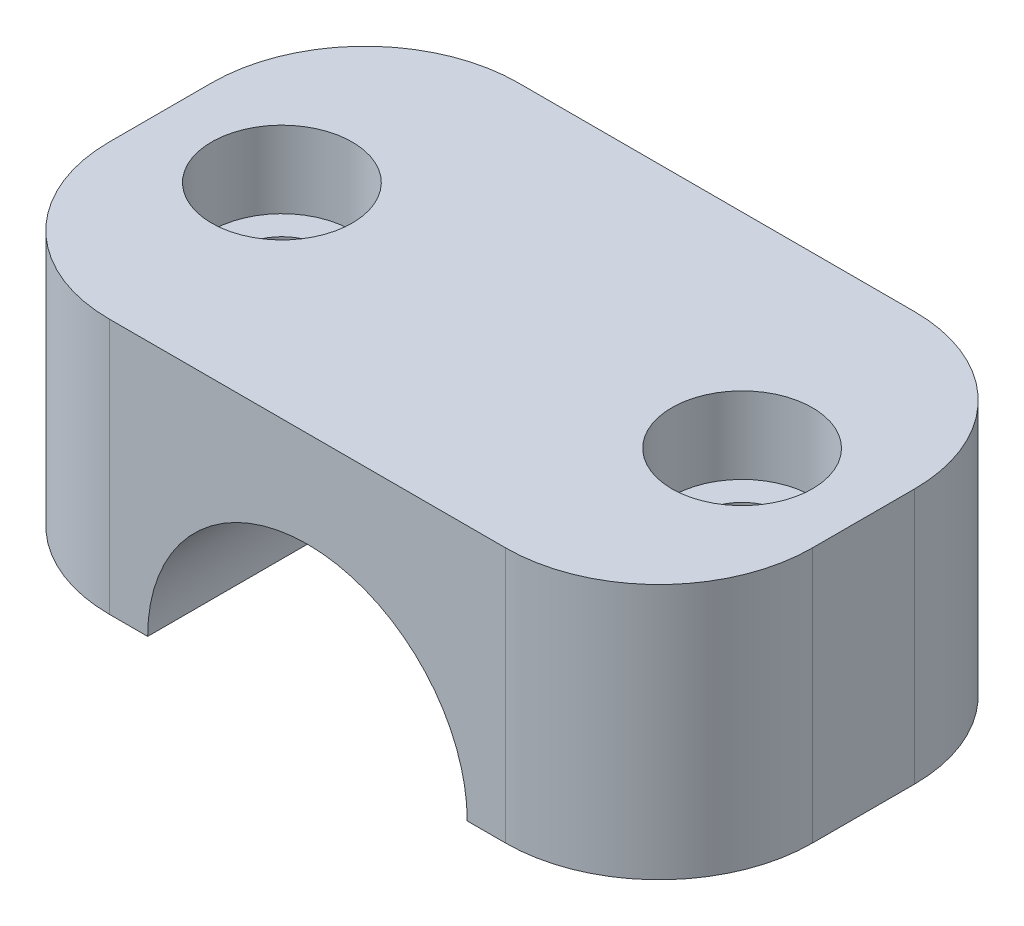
from build123d import *

# Parameters (mm, degrees)
SKETCH1_W                      = 55
SKETCH1_H                      = 20
BOSS_EXTRUDE1_DEPTH            = 16
SKETCH2_R                      = 12.5
CUT_EXTRUDE1_DEPTH             = 47.693147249
FILLET1_R                      = 12
CBORE_FOR_M6_SHCS2_D           = 6.6
CBORE_FOR_M6_SHCS2_CBORE_D     = 11
CBORE_FOR_M6_SHCS2_CBORE_DEPTH = 6


with BuildPart() as part:
    # Sketch1 → Boss-Extrude1 (new, symmetric)
    with BuildSketch(Plane.XY):
        with Locations((0, 10)):
            Rectangle(SKETCH1_W, SKETCH1_H)
    extrude(amount=BOSS_EXTRUDE1_DEPTH, both=True)

    # Sketch2 → Cut-Extrude1 (cut, through all)
    with BuildSketch(Plane.XY.offset(16)):
        Circle(SKETCH2_R)
    extrude(amount=-CUT_EXTRUDE1_DEPTH, mode=Mode.SUBTRACT)

    # Fillet1
    fillet1_edges = [part.edges().sort_by_distance(p)[0] for p in [
        (27.5, 10, 16),
        (-27.5, 10, 16),
        (27.5, 10, -16),
        (-27.5, 10, -16),
    ]]
    fillet(fillet1_edges, radius=FILLET1_R)

    # CBORE for M6 SHCS2 (through all)
    with Locations(Plane(origin=(0, 20, 0), x_dir=(1, 0, 0), z_dir=(0, 1, 0))):
        with Locations((-18, 0)):
            cbore_for_m6_shcs2 = CounterBoreHole(CBORE_FOR_M6_SHCS2_D / 2, CBORE_FOR_M6_SHCS2_CBORE_D / 2, CBORE_FOR_M6_SHCS2_CBORE_DEPTH)

    # Mirror1: CBORE for M6 SHCS2 across plane
    add(cbore_for_m6_shcs2.mirror(Plane(origin=(0, 0, 0), x_dir=(0, 0, 1), z_dir=(1, 0, 0))), mode=Mode.SUBTRACT)


solid = part.part
